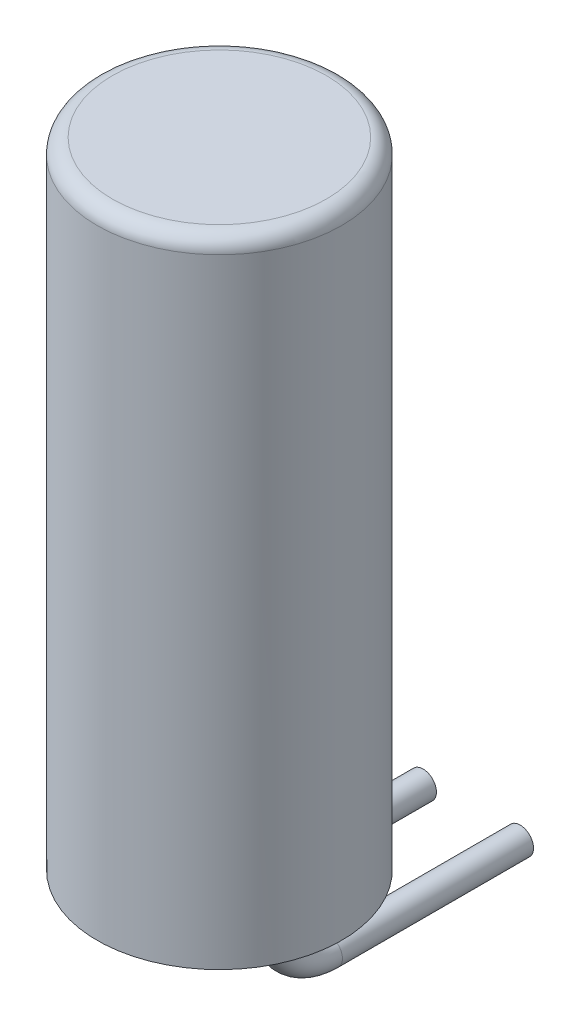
ISO-10303-21;
HEADER;
FILE_DESCRIPTION(('STEP AP214'),'2;1');
FILE_NAME('part.step','',(''),(''),'','','');
FILE_SCHEMA(('AUTOMOTIVE_DESIGN { 1 0 10303 214 1 1 1 1 }'));
ENDSEC;
DATA;
#1=APPLICATION_CONTEXT('core data for automotive mechanical design processes');
#2=APPLICATION_PROTOCOL_DEFINITION('international standard','automotive_design',2000,#1);
#3=PRODUCT_CONTEXT('',#1,'mechanical');
#4=PRODUCT('Part','Part','',(#3));
#5=PRODUCT_RELATED_PRODUCT_CATEGORY('part','',(#4));
#6=PRODUCT_DEFINITION_FORMATION('','',#4);
#7=PRODUCT_DEFINITION_CONTEXT('part definition',#1,'design');
#8=PRODUCT_DEFINITION('design','',#6,#7);
#9=PRODUCT_DEFINITION_SHAPE('','',#8);
#10=(LENGTH_UNIT() NAMED_UNIT(*) SI_UNIT(.MILLI.,.METRE.));
#11=(NAMED_UNIT(*) PLANE_ANGLE_UNIT() SI_UNIT($,.RADIAN.));
#12=(NAMED_UNIT(*) SI_UNIT($,.STERADIAN.) SOLID_ANGLE_UNIT());
#13=UNCERTAINTY_MEASURE_WITH_UNIT(LENGTH_MEASURE(1.E-05),#10,'distance_accuracy_value','');
#14=(GEOMETRIC_REPRESENTATION_CONTEXT(3) GLOBAL_UNCERTAINTY_ASSIGNED_CONTEXT((#13)) GLOBAL_UNIT_ASSIGNED_CONTEXT((#10,
#11,#12)) REPRESENTATION_CONTEXT('',''));
#15=CARTESIAN_POINT('',(0.,0.,0.));
#16=DIRECTION('',(0.,0.,1.));
#17=DIRECTION('',(1.,0.,0.));
#18=AXIS2_PLACEMENT_3D('',#15,#16,#17);
#19=CARTESIAN_POINT('',(0.,0.,0.));
#20=DIRECTION('',(0.,1.,0.));
#21=DIRECTION('',(0.,0.,1.));
#22=AXIS2_PLACEMENT_3D('',#19,#20,#21);
#23=PLANE('',#22);
#24=CARTESIAN_POINT('',(0.635,0.,0.));
#25=DIRECTION('',(0.,-1.,0.));
#26=DIRECTION('',(0.,0.,-1.));
#27=AXIS2_PLACEMENT_3D('',#24,#25,#26);
#28=CIRCLE('',#27,0.175);
#29=CARTESIAN_POINT('',(0.635,0.,-0.175));
#30=VERTEX_POINT('',#29);
#31=EDGE_CURVE('E39',#30,#30,#28,.T.);
#32=ORIENTED_EDGE('',*,*,#31,.F.);
#33=EDGE_LOOP('',(#32));
#34=FACE_BOUND('',#33,.T.);
#35=CARTESIAN_POINT('',(0.,0.,0.));
#36=DIRECTION('',(0.,1.,0.));
#37=DIRECTION('',(0.,0.,1.));
#38=AXIS2_PLACEMENT_3D('',#35,#36,#37);
#39=CIRCLE('',#38,1.6);
#40=CARTESIAN_POINT('',(0.,0.,-1.6));
#41=VERTEX_POINT('',#40);
#42=EDGE_CURVE('E63',#41,#41,#39,.T.);
#43=ORIENTED_EDGE('',*,*,#42,.F.);
#44=EDGE_LOOP('',(#43));
#45=FACE_BOUND('',#44,.T.);
#46=CARTESIAN_POINT('',(-0.635,0.,0.));
#47=DIRECTION('',(0.,-1.,0.));
#48=DIRECTION('',(0.,0.,1.));
#49=AXIS2_PLACEMENT_3D('',#46,#47,#48);
#50=CIRCLE('',#49,0.175);
#51=CARTESIAN_POINT('',(-0.635,0.,0.175));
#52=VERTEX_POINT('',#51);
#53=EDGE_CURVE('E10',#52,#52,#50,.T.);
#54=ORIENTED_EDGE('',*,*,#53,.F.);
#55=EDGE_LOOP('',(#54));
#56=FACE_BOUND('',#55,.T.);
#57=ADVANCED_FACE('F31',(#34,#45,#56),#23,.F.);
#58=CARTESIAN_POINT('',(0.,8.3,0.));
#59=DIRECTION('',(0.,-1.,0.));
#60=DIRECTION('',(0.,0.,-1.));
#61=AXIS2_PLACEMENT_3D('',#58,#59,#60);
#62=CYLINDRICAL_SURFACE('',#61,1.6);
#63=CARTESIAN_POINT('',(0.,8.1,0.));
#64=DIRECTION('',(0.,1.,0.));
#65=DIRECTION('',(0.,0.,1.));
#66=AXIS2_PLACEMENT_3D('',#63,#64,#65);
#67=CIRCLE('',#66,1.6);
#68=CARTESIAN_POINT('',(0.,8.1,-1.6));
#69=VERTEX_POINT('',#68);
#70=EDGE_CURVE('E35',#69,#69,#67,.F.);
#71=CARTESIAN_POINT('',(0.,8.1,-1.6));
#72=CARTESIAN_POINT('',(0.,8.015625,-1.6));
#73=CARTESIAN_POINT('',(0.,7.93125,-1.6));
#74=CARTESIAN_POINT('',(0.,7.7625,-1.6));
#75=CARTESIAN_POINT('',(0.,7.678125,-1.6));
#76=CARTESIAN_POINT('',(0.,7.509375,-1.6));
#77=CARTESIAN_POINT('',(0.,7.425,-1.6));
#78=CARTESIAN_POINT('',(0.,7.25625,-1.6));
#79=CARTESIAN_POINT('',(0.,7.171875,-1.6));
#80=CARTESIAN_POINT('',(0.,7.003125,-1.6));
#81=CARTESIAN_POINT('',(0.,6.91875,-1.6));
#82=CARTESIAN_POINT('',(0.,6.75,-1.6));
#83=CARTESIAN_POINT('',(0.,6.665625,-1.6));
#84=CARTESIAN_POINT('',(0.,6.496875,-1.6));
#85=CARTESIAN_POINT('',(0.,6.4125,-1.6));
#86=CARTESIAN_POINT('',(0.,6.24375,-1.6));
#87=CARTESIAN_POINT('',(0.,6.159375,-1.6));
#88=CARTESIAN_POINT('',(0.,5.990625,-1.6));
#89=CARTESIAN_POINT('',(0.,5.90625,-1.6));
#90=CARTESIAN_POINT('',(0.,5.7375,-1.6));
#91=CARTESIAN_POINT('',(0.,5.653125,-1.6));
#92=CARTESIAN_POINT('',(0.,5.484375,-1.6));
#93=CARTESIAN_POINT('',(0.,5.4,-1.6));
#94=CARTESIAN_POINT('',(0.,5.23125,-1.6));
#95=CARTESIAN_POINT('',(0.,5.146875,-1.6));
#96=CARTESIAN_POINT('',(0.,4.978125,-1.6));
#97=CARTESIAN_POINT('',(0.,4.89375,-1.6));
#98=CARTESIAN_POINT('',(0.,4.725,-1.6));
#99=CARTESIAN_POINT('',(0.,4.640625,-1.6));
#100=CARTESIAN_POINT('',(0.,4.471875,-1.6));
#101=CARTESIAN_POINT('',(0.,4.3875,-1.6));
#102=CARTESIAN_POINT('',(0.,4.21875,-1.6));
#103=CARTESIAN_POINT('',(0.,4.134375,-1.6));
#104=CARTESIAN_POINT('',(0.,3.965625,-1.6));
#105=CARTESIAN_POINT('',(0.,3.88125,-1.6));
#106=CARTESIAN_POINT('',(0.,3.7125,-1.6));
#107=CARTESIAN_POINT('',(0.,3.628125,-1.6));
#108=CARTESIAN_POINT('',(0.,3.459375,-1.6));
#109=CARTESIAN_POINT('',(0.,3.375,-1.6));
#110=CARTESIAN_POINT('',(0.,3.20625,-1.6));
#111=CARTESIAN_POINT('',(0.,3.121875,-1.6));
#112=CARTESIAN_POINT('',(0.,2.953125,-1.6));
#113=CARTESIAN_POINT('',(0.,2.86875,-1.6));
#114=CARTESIAN_POINT('',(0.,2.7,-1.6));
#115=CARTESIAN_POINT('',(0.,2.615625,-1.6));
#116=CARTESIAN_POINT('',(0.,2.446875,-1.6));
#117=CARTESIAN_POINT('',(0.,2.3625,-1.6));
#118=CARTESIAN_POINT('',(0.,2.19375,-1.6));
#119=CARTESIAN_POINT('',(0.,2.109375,-1.6));
#120=CARTESIAN_POINT('',(0.,1.940625,-1.6));
#121=CARTESIAN_POINT('',(0.,1.85625,-1.6));
#122=CARTESIAN_POINT('',(0.,1.6875,-1.6));
#123=CARTESIAN_POINT('',(0.,1.603125,-1.6));
#124=CARTESIAN_POINT('',(0.,1.434375,-1.6));
#125=CARTESIAN_POINT('',(0.,1.35,-1.6));
#126=CARTESIAN_POINT('',(0.,1.18125,-1.6));
#127=CARTESIAN_POINT('',(0.,1.096875,-1.6));
#128=CARTESIAN_POINT('',(0.,0.928125,-1.6));
#129=CARTESIAN_POINT('',(0.,0.84375,-1.6));
#130=CARTESIAN_POINT('',(0.,0.675,-1.6));
#131=CARTESIAN_POINT('',(0.,0.590625,-1.6));
#132=CARTESIAN_POINT('',(0.,0.421875,-1.6));
#133=CARTESIAN_POINT('',(0.,0.3375,-1.6));
#134=CARTESIAN_POINT('',(0.,0.16875,-1.6));
#135=CARTESIAN_POINT('',(0.,0.0843750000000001,-1.6));
#136=CARTESIAN_POINT('',(0.,0.,-1.6));
#137=B_SPLINE_CURVE_WITH_KNOTS('',3,(#71,#72,#73,#74,#75,#76,#77,#78,#79,#80,#81,#82,#83,#84,
#85,#86,#87,#88,#89,#90,#91,#92,#93,#94,#95,#96,#97,#98,#99,#100,#101,#102,#103,#104,#105,#106,
#107,#108,#109,#110,#111,#112,#113,#114,#115,#116,#117,#118,#119,#120,#121,#122,#123,#124,#125,
#126,#127,#128,#129,#130,#131,#132,#133,#134,#135,#136),.UNSPECIFIED.,.F.,.F.,(4,2,2,2,2,2,2,2,
2,2,2,2,2,2,2,2,2,2,2,2,2,2,2,2,2,2,2,2,2,2,2,2,4),(0.,0.253125,0.506249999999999,
0.759374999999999,1.0125,1.265625,1.51875,1.771875,2.025,2.278125,2.53125,2.784375,3.0375,
3.290625,3.54375,3.796875,4.05,4.303125,4.55625,4.809375,5.0625,5.315625,5.56875,5.821875,6.075,
6.328125,6.58125,6.834375,7.0875,7.340625,7.59375,7.846875,8.1),.UNSPECIFIED.);
#138=EDGE_CURVE('BSEAM72',#69,#41,#137,.T.);
#139=ORIENTED_EDGE('',*,*,#70,.T.);
#140=ORIENTED_EDGE('',*,*,#42,.T.);
#141=ORIENTED_EDGE('',*,*,#138,.T.);
#142=ORIENTED_EDGE('',*,*,#138,.F.);
#143=EDGE_LOOP('',(#139,#141,#140,#142));
#144=FACE_BOUND('',#143,.T.);
#145=ADVANCED_FACE('F72',(#144),#62,.T.);
#146=CARTESIAN_POINT('',(0.,8.3,0.));
#147=DIRECTION('',(0.,1.,0.));
#148=DIRECTION('',(0.,0.,1.));
#149=AXIS2_PLACEMENT_3D('',#146,#147,#148);
#150=PLANE('',#149);
#151=CARTESIAN_POINT('',(0.,8.3,0.));
#152=DIRECTION('',(0.,1.,0.));
#153=DIRECTION('',(0.,0.,1.));
#154=AXIS2_PLACEMENT_3D('',#151,#152,#153);
#155=CIRCLE('',#154,1.4);
#156=CARTESIAN_POINT('',(0.,8.3,1.4));
#157=VERTEX_POINT('',#156);
#158=EDGE_CURVE('E65',#157,#157,#155,.T.);
#159=ORIENTED_EDGE('',*,*,#158,.T.);
#160=EDGE_LOOP('',(#159));
#161=FACE_BOUND('',#160,.T.);
#162=ADVANCED_FACE('F78',(#161),#150,.T.);
#163=CARTESIAN_POINT('',(0.,8.1,0.));
#164=DIRECTION('',(0.,1.,0.));
#165=DIRECTION('',(0.,0.,1.));
#166=AXIS2_PLACEMENT_3D('',#163,#164,#165);
#167=TOROIDAL_SURFACE('',#166,1.4,0.2);
#168=ORIENTED_EDGE('',*,*,#70,.F.);
#169=EDGE_LOOP('',(#168));
#170=FACE_BOUND('',#169,.T.);
#171=ORIENTED_EDGE('',*,*,#158,.F.);
#172=EDGE_LOOP('',(#171));
#173=FACE_BOUND('',#172,.T.);
#174=ADVANCED_FACE('F33',(#170,#173),#167,.T.);
#175=CARTESIAN_POINT('',(0.635,-1.,-0.800000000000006));
#176=DIRECTION('',(0.,0.,-1.));
#177=DIRECTION('',(-1.,0.,0.));
#178=AXIS2_PLACEMENT_3D('',#175,#176,#177);
#179=CYLINDRICAL_SURFACE('',#178,0.175);
#180=CARTESIAN_POINT('',(0.635,-1.,-0.800000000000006));
#181=DIRECTION('',(0.,0.,-1.));
#182=DIRECTION('',(0.,1.,0.));
#183=AXIS2_PLACEMENT_3D('',#180,#181,#182);
#184=CIRCLE('',#183,0.175);
#185=CARTESIAN_POINT('',(0.635,-1.175,-0.800000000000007));
#186=VERTEX_POINT('',#185);
#187=EDGE_CURVE('E56',#186,#186,#184,.T.);
#188=ORIENTED_EDGE('',*,*,#187,.T.);
#189=EDGE_LOOP('',(#188));
#190=FACE_BOUND('',#189,.T.);
#191=CARTESIAN_POINT('',(0.635,-1.,-3.3));
#192=DIRECTION('',(0.,0.,-1.));
#193=DIRECTION('',(0.,1.,0.));
#194=AXIS2_PLACEMENT_3D('',#191,#192,#193);
#195=CIRCLE('',#194,0.175);
#196=CARTESIAN_POINT('',(0.635,-0.825,-3.3));
#197=VERTEX_POINT('',#196);
#198=EDGE_CURVE('E60',#197,#197,#195,.T.);
#199=ORIENTED_EDGE('',*,*,#198,.F.);
#200=EDGE_LOOP('',(#199));
#201=FACE_BOUND('',#200,.T.);
#202=ADVANCED_FACE('F77',(#190,#201),#179,.T.);
#203=CARTESIAN_POINT('',(0.635,-0.2,-0.8));
#204=DIRECTION('',(1.,0.,0.));
#205=DIRECTION('',(0.,0.,-1.));
#206=AXIS2_PLACEMENT_3D('',#203,#204,#205);
#207=TOROIDAL_SURFACE('',#206,0.8,0.175);
#208=CARTESIAN_POINT('',(0.635,-0.199999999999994,0.));
#209=DIRECTION('',(0.,-1.,0.));
#210=DIRECTION('',(0.,0.,-1.));
#211=AXIS2_PLACEMENT_3D('',#208,#209,#210);
#212=CIRCLE('',#211,0.175);
#213=CARTESIAN_POINT('',(0.635,-0.199999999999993,0.175));
#214=VERTEX_POINT('',#213);
#215=EDGE_CURVE('E54',#214,#214,#212,.T.);
#216=CARTESIAN_POINT('',(0.635,-0.2,-0.8));
#217=DIRECTION('',(1.,0.,0.));
#218=DIRECTION('',(0.,0.,-1.));
#219=AXIS2_PLACEMENT_3D('',#216,#217,#218);
#220=CIRCLE('',#219,0.975);
#221=EDGE_CURVE('',#214,#186,#220,.T.);
#222=ORIENTED_EDGE('',*,*,#215,.T.);
#223=ORIENTED_EDGE('',*,*,#187,.F.);
#224=ORIENTED_EDGE('',*,*,#221,.T.);
#225=ORIENTED_EDGE('',*,*,#221,.F.);
#226=EDGE_LOOP('',(#222,#224,#223,#225));
#227=FACE_BOUND('',#226,.T.);
#228=ADVANCED_FACE('F83',(#227),#207,.T.);
#229=CARTESIAN_POINT('',(0.635,-0.199999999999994,0.));
#230=DIRECTION('',(0.,1.,0.));
#231=DIRECTION('',(0.,0.,1.));
#232=AXIS2_PLACEMENT_3D('',#229,#230,#231);
#233=CYLINDRICAL_SURFACE('',#232,0.175);
#234=ORIENTED_EDGE('',*,*,#215,.F.);
#235=EDGE_LOOP('',(#234));
#236=FACE_BOUND('',#235,.T.);
#237=ORIENTED_EDGE('',*,*,#31,.T.);
#238=EDGE_LOOP('',(#237));
#239=FACE_BOUND('',#238,.T.);
#240=ADVANCED_FACE('F98',(#236,#239),#233,.T.);
#241=CARTESIAN_POINT('',(0.635,-1.,-3.3));
#242=DIRECTION('',(0.,0.,-1.));
#243=DIRECTION('',(0.,1.,0.));
#244=AXIS2_PLACEMENT_3D('',#241,#242,#243);
#245=PLANE('',#244);
#246=ORIENTED_EDGE('',*,*,#198,.T.);
#247=EDGE_LOOP('',(#246));
#248=FACE_BOUND('',#247,.T.);
#249=ADVANCED_FACE('F102',(#248),#245,.T.);
#250=CARTESIAN_POINT('',(-0.635,-1.,-0.800000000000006));
#251=DIRECTION('',(0.,0.,-1.));
#252=DIRECTION('',(-1.,0.,0.));
#253=AXIS2_PLACEMENT_3D('',#250,#251,#252);
#254=CYLINDRICAL_SURFACE('',#253,0.175);
#255=CARTESIAN_POINT('',(-0.635,-1.,-0.800000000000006));
#256=DIRECTION('',(0.,0.,-1.));
#257=DIRECTION('',(0.,-1.,0.));
#258=AXIS2_PLACEMENT_3D('',#255,#256,#257);
#259=CIRCLE('',#258,0.175);
#260=CARTESIAN_POINT('',(-0.635,-1.175,-0.800000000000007));
#261=VERTEX_POINT('',#260);
#262=EDGE_CURVE('E48',#261,#261,#259,.T.);
#263=ORIENTED_EDGE('',*,*,#262,.T.);
#264=EDGE_LOOP('',(#263));
#265=FACE_BOUND('',#264,.T.);
#266=CARTESIAN_POINT('',(-0.635,-1.,-3.3));
#267=DIRECTION('',(0.,0.,-1.));
#268=DIRECTION('',(0.,-1.,0.));
#269=AXIS2_PLACEMENT_3D('',#266,#267,#268);
#270=CIRCLE('',#269,0.175);
#271=CARTESIAN_POINT('',(-0.635,-1.175,-3.3));
#272=VERTEX_POINT('',#271);
#273=EDGE_CURVE('E51',#272,#272,#270,.T.);
#274=ORIENTED_EDGE('',*,*,#273,.F.);
#275=EDGE_LOOP('',(#274));
#276=FACE_BOUND('',#275,.T.);
#277=ADVANCED_FACE('F106',(#265,#276),#254,.T.);
#278=CARTESIAN_POINT('',(-0.635,-0.2,-0.8));
#279=DIRECTION('',(1.,0.,0.));
#280=DIRECTION('',(0.,0.,-1.));
#281=AXIS2_PLACEMENT_3D('',#278,#279,#280);
#282=TOROIDAL_SURFACE('',#281,0.8,0.175);
#283=CARTESIAN_POINT('',(-0.635,-0.199999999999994,0.));
#284=DIRECTION('',(0.,-1.,0.));
#285=DIRECTION('',(0.,0.,1.));
#286=AXIS2_PLACEMENT_3D('',#283,#284,#285);
#287=CIRCLE('',#286,0.175);
#288=CARTESIAN_POINT('',(-0.635,-0.199999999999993,0.175));
#289=VERTEX_POINT('',#288);
#290=EDGE_CURVE('E47',#289,#289,#287,.T.);
#291=CARTESIAN_POINT('',(-0.635,-0.2,-0.8));
#292=DIRECTION('',(1.,0.,0.));
#293=DIRECTION('',(0.,0.,-1.));
#294=AXIS2_PLACEMENT_3D('',#291,#292,#293);
#295=CIRCLE('',#294,0.975);
#296=EDGE_CURVE('',#289,#261,#295,.T.);
#297=ORIENTED_EDGE('',*,*,#290,.T.);
#298=ORIENTED_EDGE('',*,*,#262,.F.);
#299=ORIENTED_EDGE('',*,*,#296,.T.);
#300=ORIENTED_EDGE('',*,*,#296,.F.);
#301=EDGE_LOOP('',(#297,#299,#298,#300));
#302=FACE_BOUND('',#301,.T.);
#303=ADVANCED_FACE('F110',(#302),#282,.T.);
#304=CARTESIAN_POINT('',(-0.635,-0.199999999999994,0.));
#305=DIRECTION('',(0.,1.,0.));
#306=DIRECTION('',(0.,0.,1.));
#307=AXIS2_PLACEMENT_3D('',#304,#305,#306);
#308=CYLINDRICAL_SURFACE('',#307,0.175);
#309=ORIENTED_EDGE('',*,*,#290,.F.);
#310=EDGE_LOOP('',(#309));
#311=FACE_BOUND('',#310,.T.);
#312=ORIENTED_EDGE('',*,*,#53,.T.);
#313=EDGE_LOOP('',(#312));
#314=FACE_BOUND('',#313,.T.);
#315=ADVANCED_FACE('F114',(#311,#314),#308,.T.);
#316=CARTESIAN_POINT('',(-0.635,-1.,-3.3));
#317=DIRECTION('',(0.,0.,1.));
#318=DIRECTION('',(0.,-1.,0.));
#319=AXIS2_PLACEMENT_3D('',#316,#317,#318);
#320=PLANE('',#319);
#321=ORIENTED_EDGE('',*,*,#273,.T.);
#322=EDGE_LOOP('',(#321));
#323=FACE_BOUND('',#322,.T.);
#324=ADVANCED_FACE('F118',(#323),#320,.F.);
#325=CLOSED_SHELL('',(#57,#145,#162,#174,#202,#228,#240,#249,#277,#303,#315,#324));
#326=MANIFOLD_SOLID_BREP('B2',#325);
#327=ADVANCED_BREP_SHAPE_REPRESENTATION('',(#18,#326),#14);
#328=SHAPE_DEFINITION_REPRESENTATION(#9,#327);
ENDSEC;
END-ISO-10303-21;
